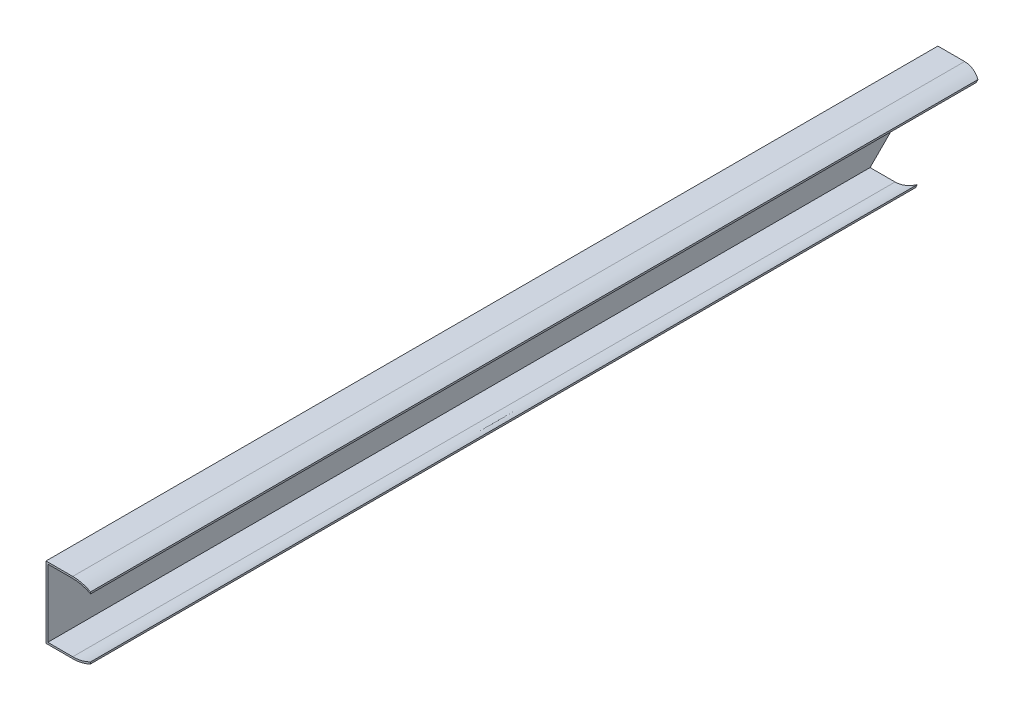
ISO-10303-21;
HEADER;
FILE_DESCRIPTION(('STEP AP214'),'2;1');
FILE_NAME('part.step','',(''),(''),'','','');
FILE_SCHEMA(('AUTOMOTIVE_DESIGN { 1 0 10303 214 1 1 1 1 }'));
ENDSEC;
DATA;
#1=APPLICATION_CONTEXT('core data for automotive mechanical design processes');
#2=APPLICATION_PROTOCOL_DEFINITION('international standard','automotive_design',2000,#1);
#3=PRODUCT_CONTEXT('',#1,'mechanical');
#4=PRODUCT('Part','Part','',(#3));
#5=PRODUCT_RELATED_PRODUCT_CATEGORY('part','',(#4));
#6=PRODUCT_DEFINITION_FORMATION('','',#4);
#7=PRODUCT_DEFINITION_CONTEXT('part definition',#1,'design');
#8=PRODUCT_DEFINITION('design','',#6,#7);
#9=PRODUCT_DEFINITION_SHAPE('','',#8);
#10=(LENGTH_UNIT() NAMED_UNIT(*) SI_UNIT(.MILLI.,.METRE.));
#11=(NAMED_UNIT(*) PLANE_ANGLE_UNIT() SI_UNIT($,.RADIAN.));
#12=(NAMED_UNIT(*) SI_UNIT($,.STERADIAN.) SOLID_ANGLE_UNIT());
#13=UNCERTAINTY_MEASURE_WITH_UNIT(LENGTH_MEASURE(1.E-05),#10,'distance_accuracy_value','');
#14=(GEOMETRIC_REPRESENTATION_CONTEXT(3) GLOBAL_UNCERTAINTY_ASSIGNED_CONTEXT((#13)) GLOBAL_UNIT_ASSIGNED_CONTEXT((#10,
#11,#12)) REPRESENTATION_CONTEXT('',''));
#15=CARTESIAN_POINT('',(0.,0.,0.));
#16=DIRECTION('',(0.,0.,1.));
#17=DIRECTION('',(1.,0.,0.));
#18=AXIS2_PLACEMENT_3D('',#15,#16,#17);
#19=CARTESIAN_POINT('',(0.,0.,1000.));
#20=DIRECTION('',(0.,1.,0.));
#21=DIRECTION('',(0.,0.,1.));
#22=AXIS2_PLACEMENT_3D('',#19,#20,#21);
#23=PLANE('',#22);
#24=DIRECTION('',(0.,0.,-1.));
#25=VECTOR('',#24,1.);
#26=CARTESIAN_POINT('',(0.,0.,1000.));
#27=LINE('',#26,#25);
#28=CARTESIAN_POINT('',(0.,0.,1000.));
#29=VERTEX_POINT('',#28);
#30=CARTESIAN_POINT('',(0.,0.,79.9999999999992));
#31=VERTEX_POINT('',#30);
#32=EDGE_CURVE('E132',#29,#31,#27,.T.);
#33=ORIENTED_EDGE('',*,*,#32,.T.);
#34=DIRECTION('',(-1.,0.,0.));
#35=VECTOR('',#34,1.);
#36=CARTESIAN_POINT('',(50.001,0.,79.9999999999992));
#37=LINE('',#36,#35);
#38=CARTESIAN_POINT('',(30.,0.,79.9999999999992));
#39=VERTEX_POINT('',#38);
#40=EDGE_CURVE('E118',#39,#31,#37,.T.);
#41=ORIENTED_EDGE('',*,*,#40,.F.);
#42=DIRECTION('',(0.,0.,-1.));
#43=VECTOR('',#42,1.);
#44=CARTESIAN_POINT('',(30.,0.,1000.));
#45=LINE('',#44,#43);
#46=CARTESIAN_POINT('',(30.,0.,1000.));
#47=VERTEX_POINT('',#46);
#48=EDGE_CURVE('E11',#47,#39,#45,.T.);
#49=ORIENTED_EDGE('',*,*,#48,.F.);
#50=DIRECTION('',(1.,0.,0.));
#51=VECTOR('',#50,1.);
#52=CARTESIAN_POINT('',(0.,0.,1000.));
#53=LINE('',#52,#51);
#54=EDGE_CURVE('E137',#29,#47,#53,.T.);
#55=ORIENTED_EDGE('',*,*,#54,.F.);
#56=EDGE_LOOP('',(#33,#41,#49,#55));
#57=FACE_BOUND('',#56,.T.);
#58=ADVANCED_FACE('F32',(#57),#23,.F.);
#59=CARTESIAN_POINT('',(30.,0.,1000.));
#60=CARTESIAN_POINT('',(40.6032812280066,0.0484567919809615,1000.));
#61=CARTESIAN_POINT('',(50.,5.,1000.));
#62=B_SPLINE_CURVE_WITH_KNOTS('',2,(#59,#60,#61),.UNSPECIFIED.,.F.,.F.,(3,3),(0.,1.),.UNSPECIFIED.);
#63=DIRECTION('',(0.,0.,-1.));
#64=VECTOR('',#63,1.);
#65=SURFACE_OF_LINEAR_EXTRUSION('',#62,#64);
#66=ORIENTED_EDGE('',*,*,#48,.T.);
#67=CARTESIAN_POINT('',(50.,5.,74.9999999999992));
#68=CARTESIAN_POINT('',(49.5210550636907,4.74761460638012,75.2523853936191));
#69=CARTESIAN_POINT('',(49.0347280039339,4.50214773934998,75.4978522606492));
#70=CARTESIAN_POINT('',(48.0467010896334,4.02606279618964,75.9739372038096));
#71=CARTESIAN_POINT('',(47.544979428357,3.79546736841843,76.2045326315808));
#72=CARTESIAN_POINT('',(46.5267291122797,3.35078644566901,76.6492135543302));
#73=CARTESIAN_POINT('',(46.0101932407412,3.136709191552,76.8632908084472));
#74=CARTESIAN_POINT('',(44.9634416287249,2.72679072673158,77.2732092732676));
#75=CARTESIAN_POINT('',(44.4332389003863,2.53093293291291,77.4690670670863));
#76=CARTESIAN_POINT('',(43.3596325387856,2.1587101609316,77.8412898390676));
#77=CARTESIAN_POINT('',(42.8162357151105,1.98233537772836,78.0176646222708));
#78=CARTESIAN_POINT('',(41.71717020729,1.65035131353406,78.3496486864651));
#79=CARTESIAN_POINT('',(41.1615076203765,1.49473197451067,78.5052680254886));
#80=CARTESIAN_POINT('',(40.1825845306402,1.24237137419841,78.7576286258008));
#81=CARTESIAN_POINT('',(39.7618260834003,1.14075340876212,78.8592465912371));
#82=CARTESIAN_POINT('',(38.9146879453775,0.950024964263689,79.0499750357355));
#83=CARTESIAN_POINT('',(38.4883085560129,0.860913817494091,79.1390861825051));
#84=CARTESIAN_POINT('',(37.6310401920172,0.695625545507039,79.3043744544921));
#85=CARTESIAN_POINT('',(37.2001563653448,0.619435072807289,79.3805649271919));
#86=CARTESIAN_POINT('',(36.334174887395,0.480132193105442,79.5198678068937));
#87=CARTESIAN_POINT('',(35.8990771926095,0.417019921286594,79.5829800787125));
#88=CARTESIAN_POINT('',(35.0123765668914,0.302350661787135,79.697649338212));
#89=CARTESIAN_POINT('',(34.560669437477,0.251196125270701,79.7488038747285));
#90=CARTESIAN_POINT('',(33.6544975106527,0.163011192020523,79.8369888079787));
#91=CARTESIAN_POINT('',(33.200032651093,0.125981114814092,79.8740188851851));
#92=CARTESIAN_POINT('',(32.2884626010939,0.0659644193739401,79.9340355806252));
#93=CARTESIAN_POINT('',(31.831354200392,0.0430022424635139,79.9569977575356));
#94=CARTESIAN_POINT('',(30.91618017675,0.0110581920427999,79.9889418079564));
#95=CARTESIAN_POINT('',(30.4581145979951,0.00207568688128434,79.9979243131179));
#96=CARTESIAN_POINT('',(30.0000000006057,2.77340272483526E-12,79.9999999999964));
#97=B_SPLINE_CURVE_WITH_KNOTS('',3,(#67,#68,#69,#70,#71,#72,#73,#74,#75,#76,#77,#78,#79,#80,#81,
#82,#83,#84,#85,#86,#87,#88,#89,#90,#91,#92,#93,#94,#95,#96),.UNSPECIFIED.,.F.,.F.,(4,2,2,2,2,2,
2,2,2,2,2,2,2,2,4),(0.,1.7919271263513,3.58652177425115,5.38200602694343,7.17583972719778,
8.96876650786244,10.7608212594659,12.0943329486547,13.4277734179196,14.7598278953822,
16.0918961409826,17.463838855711,18.8358126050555,20.2101632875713,21.5844518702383),.UNSPECIFIED.);
#98=CARTESIAN_POINT('',(50.,5.,74.9999999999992));
#99=VERTEX_POINT('',#98);
#100=EDGE_CURVE('E124',#99,#39,#97,.T.);
#101=ORIENTED_EDGE('',*,*,#100,.F.);
#102=DIRECTION('',(0.,0.,-1.));
#103=VECTOR('',#102,1.);
#104=CARTESIAN_POINT('',(50.,5.,1000.));
#105=LINE('',#104,#103);
#106=CARTESIAN_POINT('',(50.,5.,1000.));
#107=VERTEX_POINT('',#106);
#108=EDGE_CURVE('E41',#107,#99,#105,.T.);
#109=ORIENTED_EDGE('',*,*,#108,.F.);
#110=EDGE_CURVE('E223',#47,#107,#62,.T.);
#111=ORIENTED_EDGE('',*,*,#110,.F.);
#112=EDGE_LOOP('',(#66,#101,#109,#111));
#113=FACE_BOUND('',#112,.T.);
#114=ADVANCED_FACE('F233',(#113),#65,.F.);
#115=CARTESIAN_POINT('',(50.,5.,1000.));
#116=DIRECTION('',(-1.,0.,0.));
#117=DIRECTION('',(0.,0.,1.));
#118=AXIS2_PLACEMENT_3D('',#115,#116,#117);
#119=PLANE('',#118);
#120=ORIENTED_EDGE('',*,*,#108,.T.);
#121=DIRECTION('',(0.,-0.707106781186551,0.707106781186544));
#122=VECTOR('',#121,1.);
#123=CARTESIAN_POINT('',(50.,0.,79.9999999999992));
#124=LINE('',#123,#122);
#125=CARTESIAN_POINT('',(50.,7.00000000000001,72.9999999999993));
#126=VERTEX_POINT('',#125);
#127=EDGE_CURVE('E390',#126,#99,#124,.T.);
#128=ORIENTED_EDGE('',*,*,#127,.F.);
#129=DIRECTION('',(0.,0.,-1.));
#130=VECTOR('',#129,1.);
#131=CARTESIAN_POINT('',(50.,7.00000000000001,1000.));
#132=LINE('',#131,#130);
#133=CARTESIAN_POINT('',(50.,7.00000000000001,1000.));
#134=VERTEX_POINT('',#133);
#135=EDGE_CURVE('E179',#134,#126,#132,.T.);
#136=ORIENTED_EDGE('',*,*,#135,.F.);
#137=DIRECTION('',(0.,1.,0.));
#138=VECTOR('',#137,1.);
#139=CARTESIAN_POINT('',(50.,5.,1000.));
#140=LINE('',#139,#138);
#141=EDGE_CURVE('E228',#107,#134,#140,.T.);
#142=ORIENTED_EDGE('',*,*,#141,.F.);
#143=EDGE_LOOP('',(#120,#128,#136,#142));
#144=FACE_BOUND('',#143,.T.);
#145=ADVANCED_FACE('F236',(#144),#119,.F.);
#146=CARTESIAN_POINT('',(50.,7.00000000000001,1000.));
#147=CARTESIAN_POINT('',(40.6032812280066,2.04845679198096,1000.));
#148=CARTESIAN_POINT('',(30.,2.,1000.));
#149=B_SPLINE_CURVE_WITH_KNOTS('',2,(#146,#147,#148),.UNSPECIFIED.,.F.,.F.,(3,3),(0.,1.),.UNSPECIFIED.);
#150=DIRECTION('',(0.,0.,-1.));
#151=VECTOR('',#150,1.);
#152=SURFACE_OF_LINEAR_EXTRUSION('',#149,#151);
#153=ORIENTED_EDGE('',*,*,#135,.T.);
#154=CARTESIAN_POINT('',(30.,2.,77.9999999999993));
#155=CARTESIAN_POINT('',(30.2965221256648,2.00135208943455,77.9986479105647));
#156=CARTESIAN_POINT('',(30.5930205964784,2.00558904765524,77.9944109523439));
#157=CARTESIAN_POINT('',(31.1856963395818,2.01988890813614,77.980111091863));
#158=CARTESIAN_POINT('',(31.4818736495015,2.02995103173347,77.9700489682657));
#159=CARTESIAN_POINT('',(32.0736889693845,2.05595672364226,77.9440432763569));
#160=CARTESIAN_POINT('',(32.3693270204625,2.07189982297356,77.9281001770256));
#161=CARTESIAN_POINT('',(32.9597359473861,2.10969490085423,77.890305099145));
#162=CARTESIAN_POINT('',(33.2545071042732,2.13154468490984,77.8684553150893));
#163=CARTESIAN_POINT('',(33.8430758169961,2.18117540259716,77.818824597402));
#164=CARTESIAN_POINT('',(34.1368732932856,2.20895680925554,77.7910431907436));
#165=CARTESIAN_POINT('',(34.7232698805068,2.27044981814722,77.729550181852));
#166=CARTESIAN_POINT('',(35.0158687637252,2.3041624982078,77.6958375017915));
#167=CARTESIAN_POINT('',(35.8889009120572,2.41384806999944,77.5861519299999));
#168=CARTESIAN_POINT('',(36.467182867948,2.49858893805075,77.5014110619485));
#169=CARTESIAN_POINT('',(37.6162181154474,2.69114757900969,77.3088524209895));
#170=CARTESIAN_POINT('',(38.186968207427,2.79897484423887,77.2010251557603));
#171=CARTESIAN_POINT('',(39.3191210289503,3.03701619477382,76.9629838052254));
#172=CARTESIAN_POINT('',(39.8805226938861,3.16723281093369,76.8327671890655));
#173=CARTESIAN_POINT('',(40.9934871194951,3.44938335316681,76.5506166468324));
#174=CARTESIAN_POINT('',(41.5450291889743,3.60135801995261,76.3986419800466));
#175=CARTESIAN_POINT('',(42.6358830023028,3.92568946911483,76.0743105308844));
#176=CARTESIAN_POINT('',(43.1751963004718,4.09804364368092,75.9019563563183));
#177=CARTESIAN_POINT('',(44.2406108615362,4.46185600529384,75.5381439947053));
#178=CARTESIAN_POINT('',(44.7667154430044,4.65330933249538,75.3466906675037));
#179=CARTESIAN_POINT('',(45.560204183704,4.95948974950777,75.0405102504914));
#180=CARTESIAN_POINT('',(45.8325761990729,5.06781364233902,74.9321863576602));
#181=CARTESIAN_POINT('',(46.3733730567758,5.28921123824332,74.7107887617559));
#182=CARTESIAN_POINT('',(46.6417986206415,5.40228405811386,74.5977159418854));
#183=CARTESIAN_POINT('',(47.174672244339,5.6329865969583,74.3670134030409));
#184=CARTESIAN_POINT('',(47.439120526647,5.7506160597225,74.2493839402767));
#185=CARTESIAN_POINT('',(48.485464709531,6.22828118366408,73.7717188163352));
#186=CARTESIAN_POINT('',(49.2516390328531,6.60563986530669,73.3943601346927));
#187=CARTESIAN_POINT('',(50.,7.00000000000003,72.9999999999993));
#188=B_SPLINE_CURVE_WITH_KNOTS('',3,(#154,#155,#156,#157,#158,#159,#160,#161,#162,#163,#164,
#165,#166,#167,#168,#169,#170,#171,#172,#173,#174,#175,#176,#177,#178,#179,#180,#181,#182,#183,
#184,#185,#186,#187),.UNSPECIFIED.,.F.,.F.,(4,2,2,2,2,2,2,2,2,2,2,2,2,2,2,2,4),(0.,
0.889560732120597,1.77900258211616,2.66837351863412,3.55741448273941,4.44652637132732,
5.33579999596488,7.10646365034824,8.87785674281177,10.6494502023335,12.4244053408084,
14.1991335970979,15.973411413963,16.9108234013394,17.8480618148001,18.7852476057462,
21.5842762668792),.UNSPECIFIED.);
#189=CARTESIAN_POINT('',(30.,2.,77.9999999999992));
#190=VERTEX_POINT('',#189);
#191=EDGE_CURVE('E391',#190,#126,#188,.T.);
#192=ORIENTED_EDGE('',*,*,#191,.F.);
#193=DIRECTION('',(0.,0.,-1.));
#194=VECTOR('',#193,1.);
#195=CARTESIAN_POINT('',(30.,2.,1000.));
#196=LINE('',#195,#194);
#197=CARTESIAN_POINT('',(30.,2.,1000.));
#198=VERTEX_POINT('',#197);
#199=EDGE_CURVE('E166',#198,#190,#196,.T.);
#200=ORIENTED_EDGE('',*,*,#199,.F.);
#201=EDGE_CURVE('E247',#134,#198,#149,.T.);
#202=ORIENTED_EDGE('',*,*,#201,.F.);
#203=EDGE_LOOP('',(#153,#192,#200,#202));
#204=FACE_BOUND('',#203,.T.);
#205=ADVANCED_FACE('F240',(#204),#152,.F.);
#206=CARTESIAN_POINT('',(2.,2.,1000.));
#207=DIRECTION('',(0.,-1.,0.));
#208=DIRECTION('',(0.,0.,-1.));
#209=AXIS2_PLACEMENT_3D('',#206,#207,#208);
#210=PLANE('',#209);
#211=ORIENTED_EDGE('',*,*,#199,.T.);
#212=DIRECTION('',(1.,0.,0.));
#213=VECTOR('',#212,1.);
#214=CARTESIAN_POINT('',(50.001,2.,77.9999999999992));
#215=LINE('',#214,#213);
#216=CARTESIAN_POINT('',(2.,2.,77.9999999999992));
#217=VERTEX_POINT('',#216);
#218=EDGE_CURVE('E220',#217,#190,#215,.T.);
#219=ORIENTED_EDGE('',*,*,#218,.F.);
#220=DIRECTION('',(0.,0.,-1.));
#221=VECTOR('',#220,1.);
#222=CARTESIAN_POINT('',(2.,2.,1000.));
#223=LINE('',#222,#221);
#224=CARTESIAN_POINT('',(2.,2.,1000.));
#225=VERTEX_POINT('',#224);
#226=EDGE_CURVE('E173',#225,#217,#223,.T.);
#227=ORIENTED_EDGE('',*,*,#226,.F.);
#228=DIRECTION('',(-1.,0.,0.));
#229=VECTOR('',#228,1.);
#230=CARTESIAN_POINT('',(2.,2.,1000.));
#231=LINE('',#230,#229);
#232=EDGE_CURVE('E252',#198,#225,#231,.T.);
#233=ORIENTED_EDGE('',*,*,#232,.F.);
#234=EDGE_LOOP('',(#211,#219,#227,#233));
#235=FACE_BOUND('',#234,.T.);
#236=ADVANCED_FACE('F244',(#235),#210,.F.);
#237=CARTESIAN_POINT('',(2.,78.,1000.));
#238=DIRECTION('',(-1.,0.,0.));
#239=DIRECTION('',(0.,0.,1.));
#240=AXIS2_PLACEMENT_3D('',#237,#238,#239);
#241=PLANE('',#240);
#242=ORIENTED_EDGE('',*,*,#226,.T.);
#243=DIRECTION('',(0.,-0.707106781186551,0.707106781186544));
#244=VECTOR('',#243,1.);
#245=CARTESIAN_POINT('',(2.,0.,79.9999999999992));
#246=LINE('',#245,#244);
#247=CARTESIAN_POINT('',(2.,78.,1.99999999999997));
#248=VERTEX_POINT('',#247);
#249=EDGE_CURVE('E218',#248,#217,#246,.T.);
#250=ORIENTED_EDGE('',*,*,#249,.F.);
#251=DIRECTION('',(0.,0.,-1.));
#252=VECTOR('',#251,1.);
#253=CARTESIAN_POINT('',(2.,78.,1000.));
#254=LINE('',#253,#252);
#255=CARTESIAN_POINT('',(2.,78.,1000.));
#256=VERTEX_POINT('',#255);
#257=EDGE_CURVE('E165',#256,#248,#254,.T.);
#258=ORIENTED_EDGE('',*,*,#257,.F.);
#259=DIRECTION('',(0.,1.,0.));
#260=VECTOR('',#259,1.);
#261=CARTESIAN_POINT('',(2.,78.,1000.));
#262=LINE('',#261,#260);
#263=EDGE_CURVE('E257',#225,#256,#262,.T.);
#264=ORIENTED_EDGE('',*,*,#263,.F.);
#265=EDGE_LOOP('',(#242,#250,#258,#264));
#266=FACE_BOUND('',#265,.T.);
#267=ADVANCED_FACE('F281',(#266),#241,.F.);
#268=CARTESIAN_POINT('',(2.,78.,1000.));
#269=DIRECTION('',(0.,1.,0.));
#270=DIRECTION('',(0.,0.,1.));
#271=AXIS2_PLACEMENT_3D('',#268,#269,#270);
#272=PLANE('',#271);
#273=ORIENTED_EDGE('',*,*,#257,.T.);
#274=DIRECTION('',(-1.,0.,0.));
#275=VECTOR('',#274,1.);
#276=CARTESIAN_POINT('',(50.001,78.,1.99999999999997));
#277=LINE('',#276,#275);
#278=CARTESIAN_POINT('',(30.,78.,1.99999999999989));
#279=VERTEX_POINT('',#278);
#280=EDGE_CURVE('E221',#279,#248,#277,.T.);
#281=ORIENTED_EDGE('',*,*,#280,.F.);
#282=DIRECTION('',(0.,0.,-1.));
#283=VECTOR('',#282,1.);
#284=CARTESIAN_POINT('',(30.,78.,1000.));
#285=LINE('',#284,#283);
#286=CARTESIAN_POINT('',(30.,78.,1000.));
#287=VERTEX_POINT('',#286);
#288=EDGE_CURVE('E162',#287,#279,#285,.T.);
#289=ORIENTED_EDGE('',*,*,#288,.F.);
#290=DIRECTION('',(1.,0.,0.));
#291=VECTOR('',#290,1.);
#292=CARTESIAN_POINT('',(2.,78.,1000.));
#293=LINE('',#292,#291);
#294=EDGE_CURVE('E259',#256,#287,#293,.T.);
#295=ORIENTED_EDGE('',*,*,#294,.F.);
#296=EDGE_LOOP('',(#273,#281,#289,#295));
#297=FACE_BOUND('',#296,.T.);
#298=ADVANCED_FACE('F277',(#297),#272,.F.);
#299=CARTESIAN_POINT('',(30.,78.,1000.));
#300=CARTESIAN_POINT('',(40.6032812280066,77.951543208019,1000.));
#301=CARTESIAN_POINT('',(50.,73.,1000.));
#302=B_SPLINE_CURVE_WITH_KNOTS('',2,(#299,#300,#301),.UNSPECIFIED.,.F.,.F.,(3,3),(0.,1.),.UNSPECIFIED.);
#303=DIRECTION('',(0.,0.,-1.));
#304=VECTOR('',#303,1.);
#305=SURFACE_OF_LINEAR_EXTRUSION('',#302,#304);
#306=ORIENTED_EDGE('',*,*,#288,.T.);
#307=CARTESIAN_POINT('',(50.,73.,6.9999999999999));
#308=CARTESIAN_POINT('',(49.5210550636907,73.2523853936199,6.74761460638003));
#309=CARTESIAN_POINT('',(49.0347280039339,73.49785226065,6.50214773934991));
#310=CARTESIAN_POINT('',(48.0467010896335,73.9739372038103,6.02606279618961));
#311=CARTESIAN_POINT('',(47.5449794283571,74.2045326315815,5.79546736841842));
#312=CARTESIAN_POINT('',(46.5267291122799,74.6492135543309,5.35078644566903));
#313=CARTESIAN_POINT('',(46.0101932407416,74.8632908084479,5.13670919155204));
#314=CARTESIAN_POINT('',(44.9634416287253,75.2732092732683,4.72679072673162));
#315=CARTESIAN_POINT('',(44.4332389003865,75.469067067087,4.53093293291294));
#316=CARTESIAN_POINT('',(43.3596325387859,75.8412898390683,4.1587101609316));
#317=CARTESIAN_POINT('',(42.8162357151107,76.0176646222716,3.98233537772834));
#318=CARTESIAN_POINT('',(41.7171702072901,76.3496486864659,3.65035131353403));
#319=CARTESIAN_POINT('',(41.1615076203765,76.5052680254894,3.49473197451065));
#320=CARTESIAN_POINT('',(40.1825845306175,76.7576286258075,3.24237137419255));
#321=CARTESIAN_POINT('',(39.7618260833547,76.8592465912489,3.14075340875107));
#322=CARTESIAN_POINT('',(38.9146879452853,77.0499750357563,2.95002496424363));
#323=CARTESIAN_POINT('',(38.4883085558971,77.1390861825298,2.86091381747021));
#324=CARTESIAN_POINT('',(37.6310401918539,77.304374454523,2.69562554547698));
#325=CARTESIAN_POINT('',(37.2001563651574,77.3805649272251,2.61943507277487));
#326=CARTESIAN_POINT('',(36.3341748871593,77.5198678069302,2.48013219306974));
#327=CARTESIAN_POINT('',(35.8990771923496,77.58298007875,2.41701992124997));
#328=CARTESIAN_POINT('',(35.0123765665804,77.69764933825,2.30235066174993));
#329=CARTESIAN_POINT('',(34.5606694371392,77.748803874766,2.25119612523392));
#330=CARTESIAN_POINT('',(33.6544975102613,77.8369888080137,2.16301119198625));
#331=CARTESIAN_POINT('',(33.2000326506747,77.8740188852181,2.12598111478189));
#332=CARTESIAN_POINT('',(32.2884626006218,77.9340355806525,2.06596441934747));
#333=CARTESIAN_POINT('',(31.831354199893,77.9569977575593,2.0430022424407));
#334=CARTESIAN_POINT('',(30.9161801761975,77.9889418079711,2.01105819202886));
#335=CARTESIAN_POINT('',(30.4581145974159,77.9979243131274,2.00207568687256));
#336=CARTESIAN_POINT('',(30.,78.,2.00000000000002));
#337=B_SPLINE_CURVE_WITH_KNOTS('',3,(#307,#308,#309,#310,#311,#312,#313,#314,#315,#316,#317,
#318,#319,#320,#321,#322,#323,#324,#325,#326,#327,#328,#329,#330,#331,#332,#333,#334,#335,#336),
.UNSPECIFIED.,.F.,.F.,(4,2,2,2,2,2,2,2,2,2,2,2,2,2,4),(0.,1.79192712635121,3.5865217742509,
5.38200602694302,7.17583972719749,8.96876650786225,10.7608212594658,12.094332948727,
13.4277734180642,14.759827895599,16.0918961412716,17.4638388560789,18.8358126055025,
20.2101632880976,21.5844518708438),.UNSPECIFIED.);
#338=CARTESIAN_POINT('',(50.,73.,6.99999999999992));
#339=VERTEX_POINT('',#338);
#340=EDGE_CURVE('E186',#339,#279,#337,.T.);
#341=ORIENTED_EDGE('',*,*,#340,.F.);
#342=DIRECTION('',(0.,0.,-1.));
#343=VECTOR('',#342,1.);
#344=CARTESIAN_POINT('',(50.,73.,1000.));
#345=LINE('',#344,#343);
#346=CARTESIAN_POINT('',(50.,73.,1000.));
#347=VERTEX_POINT('',#346);
#348=EDGE_CURVE('E157',#347,#339,#345,.T.);
#349=ORIENTED_EDGE('',*,*,#348,.F.);
#350=EDGE_CURVE('E261',#287,#347,#302,.T.);
#351=ORIENTED_EDGE('',*,*,#350,.F.);
#352=EDGE_LOOP('',(#306,#341,#349,#351));
#353=FACE_BOUND('',#352,.T.);
#354=ADVANCED_FACE('F272',(#353),#305,.F.);
#355=CARTESIAN_POINT('',(50.,75.,1000.));
#356=DIRECTION('',(-1.,0.,0.));
#357=DIRECTION('',(0.,0.,1.));
#358=AXIS2_PLACEMENT_3D('',#355,#356,#357);
#359=PLANE('',#358);
#360=ORIENTED_EDGE('',*,*,#348,.T.);
#361=DIRECTION('',(0.,-0.707106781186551,0.707106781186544));
#362=VECTOR('',#361,1.);
#363=CARTESIAN_POINT('',(50.,0.,79.9999999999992));
#364=LINE('',#363,#362);
#365=CARTESIAN_POINT('',(50.,75.,5.));
#366=VERTEX_POINT('',#365);
#367=EDGE_CURVE('E184',#366,#339,#364,.T.);
#368=ORIENTED_EDGE('',*,*,#367,.F.);
#369=DIRECTION('',(0.,0.,-1.));
#370=VECTOR('',#369,1.);
#371=CARTESIAN_POINT('',(50.,75.,1000.));
#372=LINE('',#371,#370);
#373=CARTESIAN_POINT('',(50.,75.,1000.));
#374=VERTEX_POINT('',#373);
#375=EDGE_CURVE('E148',#374,#366,#372,.T.);
#376=ORIENTED_EDGE('',*,*,#375,.F.);
#377=DIRECTION('',(0.,1.,0.));
#378=VECTOR('',#377,1.);
#379=CARTESIAN_POINT('',(50.,75.,1000.));
#380=LINE('',#379,#378);
#381=EDGE_CURVE('E266',#347,#374,#380,.T.);
#382=ORIENTED_EDGE('',*,*,#381,.F.);
#383=EDGE_LOOP('',(#360,#368,#376,#382));
#384=FACE_BOUND('',#383,.T.);
#385=ADVANCED_FACE('F276',(#384),#359,.F.);
#386=CARTESIAN_POINT('',(50.,75.,1000.));
#387=CARTESIAN_POINT('',(40.6032812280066,79.951543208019,1000.));
#388=CARTESIAN_POINT('',(30.,80.,1000.));
#389=B_SPLINE_CURVE_WITH_KNOTS('',2,(#386,#387,#388),.UNSPECIFIED.,.F.,.F.,(3,3),(0.,1.),.UNSPECIFIED.);
#390=DIRECTION('',(0.,0.,-1.));
#391=VECTOR('',#390,1.);
#392=SURFACE_OF_LINEAR_EXTRUSION('',#389,#391);
#393=ORIENTED_EDGE('',*,*,#375,.T.);
#394=CARTESIAN_POINT('',(30.0000000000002,80.,0.));
#395=CARTESIAN_POINT('',(30.296522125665,79.9986479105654,0.00135208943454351));
#396=CARTESIAN_POINT('',(30.5930205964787,79.9944109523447,0.00558904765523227));
#397=CARTESIAN_POINT('',(31.185696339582,79.9801110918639,0.0198889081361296));
#398=CARTESIAN_POINT('',(31.4818736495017,79.9700489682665,0.0299510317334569));
#399=CARTESIAN_POINT('',(32.0736889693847,79.9440432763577,0.0559567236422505));
#400=CARTESIAN_POINT('',(32.3693270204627,79.9281001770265,0.0718998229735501));
#401=CARTESIAN_POINT('',(32.9597359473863,79.8903050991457,0.109694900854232));
#402=CARTESIAN_POINT('',(33.2545071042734,79.8684553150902,0.131544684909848));
#403=CARTESIAN_POINT('',(33.8430758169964,79.8188245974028,0.181175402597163));
#404=CARTESIAN_POINT('',(34.1368732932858,79.7910431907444,0.208956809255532));
#405=CARTESIAN_POINT('',(34.723269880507,79.7295501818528,0.270449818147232));
#406=CARTESIAN_POINT('',(35.0158687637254,79.6958375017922,0.304162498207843));
#407=CARTESIAN_POINT('',(35.8889009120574,79.5861519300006,0.413848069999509));
#408=CARTESIAN_POINT('',(36.4671828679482,79.5014110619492,0.498588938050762));
#409=CARTESIAN_POINT('',(37.6162181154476,79.3088524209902,0.691147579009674));
#410=CARTESIAN_POINT('',(38.1869682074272,79.2010251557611,0.79897484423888));
#411=CARTESIAN_POINT('',(39.3191210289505,78.9629838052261,1.03701619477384));
#412=CARTESIAN_POINT('',(39.8805226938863,78.8327671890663,1.1672328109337));
#413=CARTESIAN_POINT('',(40.9934871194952,78.5506166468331,1.44938335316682));
#414=CARTESIAN_POINT('',(41.5450291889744,78.3986419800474,1.60135801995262));
#415=CARTESIAN_POINT('',(42.6358830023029,78.0743105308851,1.92568946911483));
#416=CARTESIAN_POINT('',(43.1751963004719,77.901956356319,2.0980436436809));
#417=CARTESIAN_POINT('',(44.2406108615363,77.5381439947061,2.46185600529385));
#418=CARTESIAN_POINT('',(44.7667154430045,77.3466906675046,2.65330933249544));
#419=CARTESIAN_POINT('',(45.5602041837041,77.0405102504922,2.95948974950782));
#420=CARTESIAN_POINT('',(45.8325761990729,76.932186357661,3.06781364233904));
#421=CARTESIAN_POINT('',(46.3733730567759,76.7107887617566,3.2892112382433));
#422=CARTESIAN_POINT('',(46.6417986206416,76.5977159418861,3.40228405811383));
#423=CARTESIAN_POINT('',(47.1746722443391,76.3670134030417,3.63298659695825));
#424=CARTESIAN_POINT('',(47.4391205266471,76.2493839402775,3.75061605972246));
#425=CARTESIAN_POINT('',(48.4854647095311,75.7717188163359,4.22828118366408));
#426=CARTESIAN_POINT('',(49.2516390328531,75.3943601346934,4.60563986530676));
#427=CARTESIAN_POINT('',(50.,75.,5.00000000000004));
#428=B_SPLINE_CURVE_WITH_KNOTS('',3,(#394,#395,#396,#397,#398,#399,#400,#401,#402,#403,#404,
#405,#406,#407,#408,#409,#410,#411,#412,#413,#414,#415,#416,#417,#418,#419,#420,#421,#422,#423,
#424,#425,#426,#427),.UNSPECIFIED.,.F.,.F.,(4,2,2,2,2,2,2,2,2,2,2,2,2,2,2,2,4),(0.,
0.889560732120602,1.77900258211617,2.66837351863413,3.55741448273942,4.44652637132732,
5.33579999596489,7.10646365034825,8.87785674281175,10.6494502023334,12.4244053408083,
14.1991335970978,15.9734114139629,16.9108234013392,17.8480618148,18.7852476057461,
21.5842762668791),.UNSPECIFIED.);
#429=CARTESIAN_POINT('',(30.,80.,0.));
#430=VERTEX_POINT('',#429);
#431=EDGE_CURVE('E128',#430,#366,#428,.T.);
#432=ORIENTED_EDGE('',*,*,#431,.F.);
#433=DIRECTION('',(0.,0.,-1.));
#434=VECTOR('',#433,1.);
#435=CARTESIAN_POINT('',(30.,80.,1000.));
#436=LINE('',#435,#434);
#437=CARTESIAN_POINT('',(30.,80.,1000.));
#438=VERTEX_POINT('',#437);
#439=EDGE_CURVE('E139',#438,#430,#436,.T.);
#440=ORIENTED_EDGE('',*,*,#439,.F.);
#441=EDGE_CURVE('E378',#374,#438,#389,.T.);
#442=ORIENTED_EDGE('',*,*,#441,.F.);
#443=EDGE_LOOP('',(#393,#432,#440,#442));
#444=FACE_BOUND('',#443,.T.);
#445=ADVANCED_FACE('F334',(#444),#392,.F.);
#446=CARTESIAN_POINT('',(0.,80.,1000.));
#447=DIRECTION('',(0.,-1.,0.));
#448=DIRECTION('',(0.,0.,-1.));
#449=AXIS2_PLACEMENT_3D('',#446,#447,#448);
#450=PLANE('',#449);
#451=DIRECTION('',(-1.,0.,0.));
#452=VECTOR('',#451,1.);
#453=CARTESIAN_POINT('',(0.,80.,0.));
#454=LINE('',#453,#452);
#455=CARTESIAN_POINT('',(0.,80.,0.));
#456=VERTEX_POINT('',#455);
#457=EDGE_CURVE('E144',#430,#456,#454,.T.);
#458=ORIENTED_EDGE('',*,*,#457,.T.);
#459=DIRECTION('',(0.,0.,-1.));
#460=VECTOR('',#459,1.);
#461=CARTESIAN_POINT('',(0.,80.,1000.));
#462=LINE('',#461,#460);
#463=CARTESIAN_POINT('',(0.,80.,1000.));
#464=VERTEX_POINT('',#463);
#465=EDGE_CURVE('E135',#464,#456,#462,.T.);
#466=ORIENTED_EDGE('',*,*,#465,.F.);
#467=DIRECTION('',(-1.,0.,0.));
#468=VECTOR('',#467,1.);
#469=CARTESIAN_POINT('',(0.,80.,1000.));
#470=LINE('',#469,#468);
#471=EDGE_CURVE('E141',#438,#464,#470,.T.);
#472=ORIENTED_EDGE('',*,*,#471,.F.);
#473=ORIENTED_EDGE('',*,*,#439,.T.);
#474=EDGE_LOOP('',(#458,#466,#472,#473));
#475=FACE_BOUND('',#474,.T.);
#476=ADVANCED_FACE('F343',(#475),#450,.F.);
#477=CARTESIAN_POINT('',(0.,0.,1000.));
#478=DIRECTION('',(1.,0.,0.));
#479=DIRECTION('',(0.,0.,-1.));
#480=AXIS2_PLACEMENT_3D('',#477,#478,#479);
#481=PLANE('',#480);
#482=ORIENTED_EDGE('',*,*,#465,.T.);
#483=DIRECTION('',(0.,0.707106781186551,-0.707106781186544));
#484=VECTOR('',#483,1.);
#485=CARTESIAN_POINT('',(0.,0.,79.9999999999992));
#486=LINE('',#485,#484);
#487=EDGE_CURVE('E121',#31,#456,#486,.T.);
#488=ORIENTED_EDGE('',*,*,#487,.F.);
#489=ORIENTED_EDGE('',*,*,#32,.F.);
#490=DIRECTION('',(0.,-1.,0.));
#491=VECTOR('',#490,1.);
#492=CARTESIAN_POINT('',(0.,0.,1000.));
#493=LINE('',#492,#491);
#494=EDGE_CURVE('E49',#464,#29,#493,.T.);
#495=ORIENTED_EDGE('',*,*,#494,.F.);
#496=EDGE_LOOP('',(#482,#488,#489,#495));
#497=FACE_BOUND('',#496,.T.);
#498=ADVANCED_FACE('F131',(#497),#481,.F.);
#499=CARTESIAN_POINT('',(40.3016406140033,1.27422839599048,1000.));
#500=DIRECTION('',(0.,0.,-1.));
#501=DIRECTION('',(-1.,0.,0.));
#502=AXIS2_PLACEMENT_3D('',#499,#500,#501);
#503=PLANE('',#502);
#504=ORIENTED_EDGE('',*,*,#54,.T.);
#505=ORIENTED_EDGE('',*,*,#110,.T.);
#506=ORIENTED_EDGE('',*,*,#141,.T.);
#507=ORIENTED_EDGE('',*,*,#201,.T.);
#508=ORIENTED_EDGE('',*,*,#232,.T.);
#509=ORIENTED_EDGE('',*,*,#263,.T.);
#510=ORIENTED_EDGE('',*,*,#294,.T.);
#511=ORIENTED_EDGE('',*,*,#350,.T.);
#512=ORIENTED_EDGE('',*,*,#381,.T.);
#513=ORIENTED_EDGE('',*,*,#441,.T.);
#514=ORIENTED_EDGE('',*,*,#471,.T.);
#515=ORIENTED_EDGE('',*,*,#494,.T.);
#516=EDGE_LOOP('',(#504,#505,#506,#507,#508,#509,#510,#511,#512,#513,#514,#515));
#517=FACE_BOUND('',#516,.T.);
#518=ADVANCED_FACE('F361',(#517),#503,.F.);
#519=CARTESIAN_POINT('',(50.001,0.,79.9999999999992));
#520=DIRECTION('',(0.,0.707106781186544,0.707106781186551));
#521=DIRECTION('',(0.,-0.707106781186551,0.707106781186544));
#522=AXIS2_PLACEMENT_3D('',#519,#520,#521);
#523=PLANE('',#522);
#524=ORIENTED_EDGE('',*,*,#100,.T.);
#525=ORIENTED_EDGE('',*,*,#40,.T.);
#526=ORIENTED_EDGE('',*,*,#487,.T.);
#527=ORIENTED_EDGE('',*,*,#457,.F.);
#528=ORIENTED_EDGE('',*,*,#431,.T.);
#529=ORIENTED_EDGE('',*,*,#367,.T.);
#530=ORIENTED_EDGE('',*,*,#340,.T.);
#531=ORIENTED_EDGE('',*,*,#280,.T.);
#532=ORIENTED_EDGE('',*,*,#249,.T.);
#533=ORIENTED_EDGE('',*,*,#218,.T.);
#534=ORIENTED_EDGE('',*,*,#191,.T.);
#535=ORIENTED_EDGE('',*,*,#127,.T.);
#536=EDGE_LOOP('',(#524,#525,#526,#527,#528,#529,#530,#531,#532,#533,#534,#535));
#537=FACE_BOUND('',#536,.T.);
#538=ADVANCED_FACE('F120',(#537),#523,.F.);
#539=CLOSED_SHELL('',(#58,#114,#145,#205,#236,#267,#298,#354,#385,#445,#476,#498,#518,#538));
#540=MANIFOLD_SOLID_BREP('B2',#539);
#541=ADVANCED_BREP_SHAPE_REPRESENTATION('',(#18,#540),#14);
#542=SHAPE_DEFINITION_REPRESENTATION(#9,#541);
ENDSEC;
END-ISO-10303-21;
